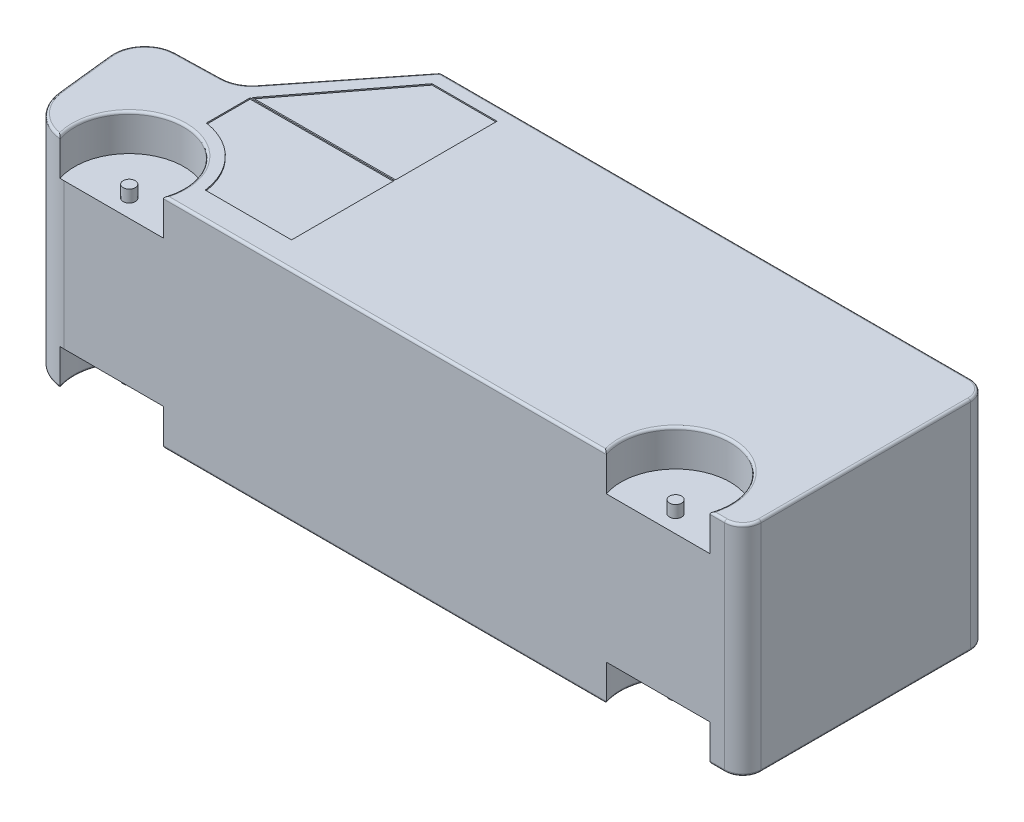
from build123d import *

# Parameters (mm, degrees)
BOSS_EXTRU_1_DEPTH      = 900
ESQUISSE2_W             = 40
ESQUISSE2_H             = 20
ENL_V_MAT_EXTRU_1_DEPTH = 30
ESQUISSE3_R             = 5
ENL_V_MAT_EXTRU_2_DEPTH = 10
ESQUISSE4_R             = 450
ESQUISSE4_R_2           = 50
ENL_V_MAT_EXTRU_3_DEPTH = 300
CONG_3_R                = 20
ESQUISSE6_W             = 1004.568945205
ESQUISSE6_H             = 1700
ENL_V_MAT_EXTRU_4_DEPTH = 5
ENL_V_MAT_EXTRU_5_DEPTH = 10
ESQUISSE8_R             = 75
ENL_V_MAT_EXTRU_6_DEPTH = 200


with BuildPart() as part:
    # Esquisse1 → Boss.-Extru.1 (new body)
    with BuildSketch(Plane(origin=(0, 0, 0), x_dir=(1, 0, 0), z_dir=(0, 1, 0))):
        with BuildLine():
            Line((14.501334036, 0), (4364.501334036, 0))
            ThreePointArc((4364.501334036, 0), (4470.567351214, -43.933982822), (4514.501334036, -150))
            Line((4514.501334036, -150), (4514.501334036, -1874.945495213))
            ThreePointArc((4514.501334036, -1874.945495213), (4470.567351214, -1981.011512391), (4364.501334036, -2024.945495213))
            Line((4364.501334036, -2024.945495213), (-1076.332250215, -2024.945495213))
            ThreePointArc((-1076.332250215, -2024.945495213), (-1316.830803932, -1932.921957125), (-1434.470879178, -1703.86148782))
            Line((-1434.470879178, -1703.86148782), (-1485.498665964, -1237.57585323))
            ThreePointArc((-1485.498665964, -1237.57585323), (-1422.794868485, -1038.175690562), (-1233.569100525, -949.373664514))
            Line((-1233.569100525, -949.373664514), (-864.434568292, -940.103465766))
            ThreePointArc((-864.434568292, -940.103465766), (-754.879950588, -912.833138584), (-667.212435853, -841.697410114))
            Line((-667.212435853, -841.697410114), (-9.008228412, -11.364000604))
            ThreePointArc((-9.008228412, -11.364000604), (1.445300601, -2.990002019), (14.501334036, 0))
        make_face()
    extrude(amount=BOSS_EXTRU_1_DEPTH)

    # Esquisse2 → Enl_v. mat.-Extru.1 (cut)
    with BuildSketch(Plane(origin=(0, 0, 0), x_dir=(-1, 0, 0), z_dir=(0, 0, -1))):
        with Locations((-1014.501334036, 0)):
            Rectangle(ESQUISSE2_W, ESQUISSE2_H)
    extrude(amount=-ENL_V_MAT_EXTRU_1_DEPTH, mode=Mode.SUBTRACT)

    # Esquisse3 → Enl_v. mat.-Extru.2 (cut)
    with BuildSketch(Plane(origin=(0, 0, 0), x_dir=(-1, 0, 0), z_dir=(0, 0, -1))):
        with Locations(Location((-264.501334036, 250, 0), (0, 0, 180))):
            Circle(ESQUISSE3_R)
    extrude(amount=-ENL_V_MAT_EXTRU_2_DEPTH, mode=Mode.SUBTRACT)

    # Esquisse4 → Enl_v. mat.-Extru.3 (cut)
    # profile 1 of 2: a face of its own
    with BuildSketch(Plane(origin=(0, 900, 0), x_dir=(1, 0, 0), z_dir=(0, 1, 0))):
        with Locations((-683.797912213, -1880.793647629)):
            Circle(ESQUISSE4_R)
        with Locations(Location((-683.797912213, -1880.793647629, 0), (0, 0, 270))):
            Circle(ESQUISSE4_R_2, mode=Mode.SUBTRACT)
    # profile 2 of 2: a face of its own
    with BuildSketch(Plane(origin=(0, 900, 0), x_dir=(1, 0, 0), z_dir=(0, 1, 0))):
        with Locations((3816.202087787, -1880.793647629)):
            Circle(ESQUISSE4_R)
        with Locations(Location((3816.202087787, -1880.793647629, 0), (0, 0, 270))):
            Circle(ESQUISSE4_R_2, mode=Mode.SUBTRACT)
    extrude(amount=-ENL_V_MAT_EXTRU_3_DEPTH, mode=Mode.SUBTRACT)

    # Cong_3
    cong_3_edges = [part.edges().sort_by_distance(p)[0] for p in [
        (-754.879950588, 900, 912.833138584),
        (-1049.001834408, 900, 944.73856514),
        (-1422.794868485, 900, 1038.175690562),
        (-1459.984772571, 900, 1470.718670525),
        (-1329.342326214, 900, 1921.155083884),
        (4470.567351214, 900, 1981.011512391),
        (4514.501334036, 900, 1012.472747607),
        (4470.567351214, 900, 43.933982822),
        (2189.501334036, 900, 0),
        (1.445300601, 900, 2.990002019),
        (1566.202087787, 900, 2024.945495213),
        (-682.934605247, 900, 1430.794475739),
        (-338.110332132, 900, 426.530705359),
        (4303.494998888, 900, 2024.945495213),
        (3816.202087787, 900, 1430.793647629),
    ]]
    fillet(cong_3_edges, radius=CONG_3_R)

    # Esquisse6 → Enl_v. mat.-Extru.4 (cut)
    with BuildSketch(Plane(origin=(0, 0, 0), x_dir=(-0.6211999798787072, 0, 0.7836520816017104), z_dir=(-0.7836520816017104, 0, -0.6211999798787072))):
        with Locations((536.785806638, 0)):
            Rectangle(ESQUISSE6_W, ESQUISSE6_H)
    extrude(amount=-ENL_V_MAT_EXTRU_4_DEPTH, mode=Mode.SUBTRACT)

    # Esquisse7 → Enl_v. mat.-Extru.5 (cut)
    with BuildSketch(Plane(origin=(0, 900, 0), x_dir=(1, 0, 0), z_dir=(0, 1, 0))):
        Polygon((582.323944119, -117.286370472), (582.29537247, -952.986925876), (-594.407782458, -956.348974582), (46.913953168, -117.286370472), align=None)
        with BuildLine():
            ThreePointArc((-128.331487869, -1810.047250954), (-283.950533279, -1488.785899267), (-602.067854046, -1326.836791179))
            Line((-602.067854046, -1326.836791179), (-602.067854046, -966.370901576))
            Line((-602.067854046, -966.370901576), (582.323944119, -962.986885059))
            Line((582.323944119, -962.986885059), (582.323944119, -1810.047250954))
            Line((582.323944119, -1810.047250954), (-128.331487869, -1810.047250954))
        make_face()
    extrude(amount=-ENL_V_MAT_EXTRU_5_DEPTH, mode=Mode.SUBTRACT)

    # Esquisse8 → Enl_v. mat.-Extru.6 (cut)
    with BuildSketch(Plane(origin=(0, 900, 0), x_dir=(1, 0, 0), z_dir=(0, 1, 0))):
        with Locations((-683.797912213, -1880.793647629)):
            Circle(ESQUISSE8_R)
        with Locations((3816.202087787, -1880.793647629)):
            Circle(ESQUISSE8_R)
    extrude(amount=-ENL_V_MAT_EXTRU_6_DEPTH, mode=Mode.SUBTRACT)

    # Sym_trie1: part across plane


with BuildPart() as part_1:
    add(part.part)
    add(part.part.mirror(Plane(origin=(14.501334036, 0, 30), x_dir=(0, 0, 1), z_dir=(0, -1, 0))))


solid = part_1.part
